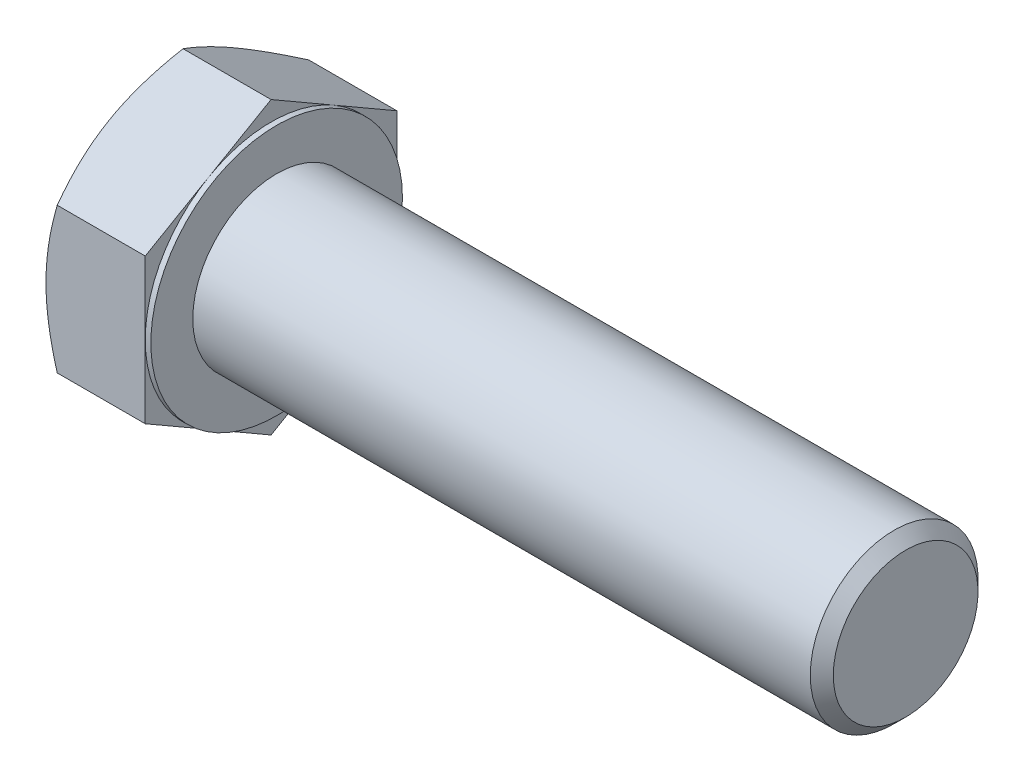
from build123d import *

# Parameters (mm, degrees)
BASEHEAD_DEPTH = 15
SKETCH4_W      = 0.8
SKETCH4_H      = 12.784609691


with BuildPart() as part:
    # Sketch1 → BaseHead (new body)
    with BuildSketch(Plane(origin=(0, 0, 0), x_dir=(0, 0, -1), z_dir=(1, 0, 0))):
        Polygon((18, 10.392304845), (18, -10.392304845), (0, -20.784609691), (-18, -10.392304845), (-18, 10.392304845), (0, 20.784609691), align=None)
    extrude(amount=BASEHEAD_DEPTH)

    # BodySke → BaseBody (revolve)
    with BuildSketch(Plane.XY, mode=Mode.PRIVATE) as basebody_sk:
        Polygon((0, 0), (105, 0), (105, 10.352), (103.352, 12), (0, 12), align=None)
    revolve(basebody_sk.sketch.rotate(Axis((0, 0, 0), (1, 0, 0)), 90), axis=Axis((0, 0, 0), (1, 0, 0)))

    # Sketch3 → HeadChamfer (revolve, cut)
    with BuildSketch(Plane.XY):
        Polygon((0, 18), (4.494446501, 25.784609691), (4.494446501, 30.784609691), (-10, 30.784609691), (-10, 18), align=None)
    revolve(axis=Axis((0, 0, 0), (1, 0, 0)), mode=Mode.SUBTRACT)

    # Sketch4 → BearingFace (revolve, cut)
    with BuildSketch(Plane.XY, mode=Mode.PRIVATE) as bearingface_sk:
        with Locations((14.6, 24.392304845)):
            Rectangle(SKETCH4_W, SKETCH4_H)
    revolve(bearingface_sk.sketch.rotate(Axis((0, 0, 0), (1, 0, 0)), 270), axis=Axis((0, 0, 0), (1, 0, 0)), mode=Mode.SUBTRACT)


solid = part.part
